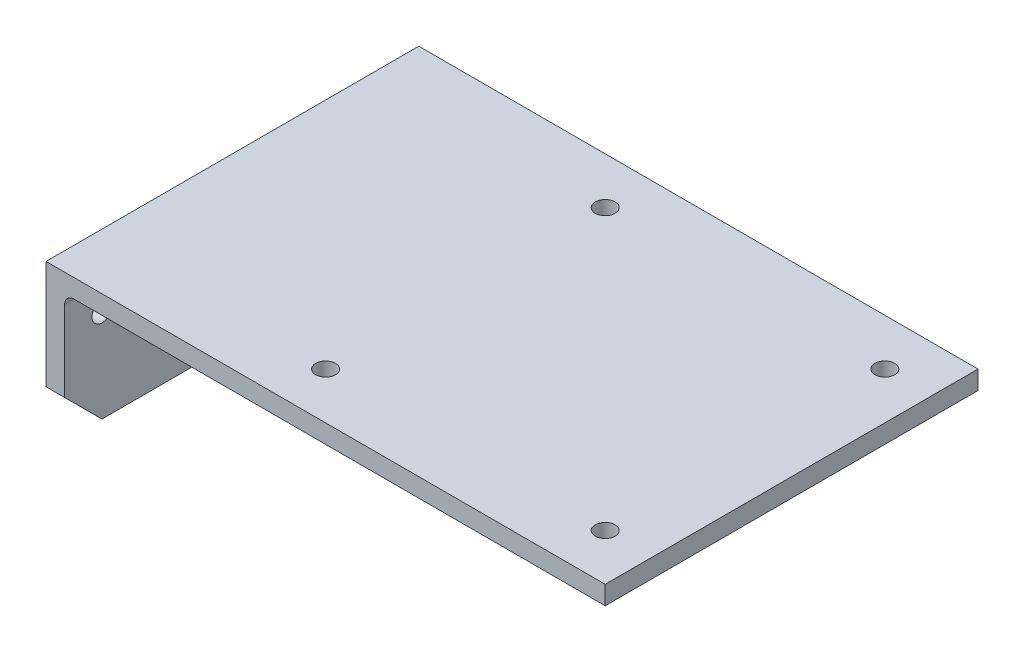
ISO-10303-21;
HEADER;
FILE_DESCRIPTION(('STEP AP214'),'2;1');
FILE_NAME('part.step','',(''),(''),'','','');
FILE_SCHEMA(('AUTOMOTIVE_DESIGN { 1 0 10303 214 1 1 1 1 }'));
ENDSEC;
DATA;
#1=APPLICATION_CONTEXT('core data for automotive mechanical design processes');
#2=APPLICATION_PROTOCOL_DEFINITION('international standard','automotive_design',2000,#1);
#3=PRODUCT_CONTEXT('',#1,'mechanical');
#4=PRODUCT('Part','Part','',(#3));
#5=PRODUCT_RELATED_PRODUCT_CATEGORY('part','',(#4));
#6=PRODUCT_DEFINITION_FORMATION('','',#4);
#7=PRODUCT_DEFINITION_CONTEXT('part definition',#1,'design');
#8=PRODUCT_DEFINITION('design','',#6,#7);
#9=PRODUCT_DEFINITION_SHAPE('','',#8);
#10=(LENGTH_UNIT() NAMED_UNIT(*) SI_UNIT(.MILLI.,.METRE.));
#11=(NAMED_UNIT(*) PLANE_ANGLE_UNIT() SI_UNIT($,.RADIAN.));
#12=(NAMED_UNIT(*) SI_UNIT($,.STERADIAN.) SOLID_ANGLE_UNIT());
#13=UNCERTAINTY_MEASURE_WITH_UNIT(LENGTH_MEASURE(1.E-05),#10,'distance_accuracy_value','');
#14=(GEOMETRIC_REPRESENTATION_CONTEXT(3) GLOBAL_UNCERTAINTY_ASSIGNED_CONTEXT((#13)) GLOBAL_UNIT_ASSIGNED_CONTEXT((#10,
#11,#12)) REPRESENTATION_CONTEXT('',''));
#15=CARTESIAN_POINT('',(0.,0.,0.));
#16=DIRECTION('',(0.,0.,1.));
#17=DIRECTION('',(1.,0.,0.));
#18=AXIS2_PLACEMENT_3D('',#15,#16,#17);
#19=CARTESIAN_POINT('',(-127.,0.,-323.871706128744));
#20=DIRECTION('',(-1.,0.,0.));
#21=DIRECTION('',(0.,0.,1.));
#22=AXIS2_PLACEMENT_3D('',#19,#20,#21);
#23=PLANE('',#22);
#24=CARTESIAN_POINT('',(-127.,-17.9311702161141,-114.3));
#25=DIRECTION('',(1.,0.,0.));
#26=DIRECTION('',(0.,-1.,0.));
#27=AXIS2_PLACEMENT_3D('',#24,#25,#26);
#28=CIRCLE('',#27,3.37819999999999);
#29=CARTESIAN_POINT('',(-127.,-21.3093702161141,-114.3));
#30=VERTEX_POINT('',#29);
#31=EDGE_CURVE('E209',#30,#30,#28,.T.);
#32=ORIENTED_EDGE('',*,*,#31,.T.);
#33=EDGE_LOOP('',(#32));
#34=FACE_BOUND('',#33,.T.);
#35=CARTESIAN_POINT('',(-127.,-36.9811702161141,-63.5));
#36=DIRECTION('',(1.,0.,0.));
#37=DIRECTION('',(0.,1.,0.));
#38=AXIS2_PLACEMENT_3D('',#35,#36,#37);
#39=CIRCLE('',#38,3.37819999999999);
#40=CARTESIAN_POINT('',(-127.,-33.6029702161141,-63.5));
#41=VERTEX_POINT('',#40);
#42=EDGE_CURVE('E203',#41,#41,#39,.T.);
#43=ORIENTED_EDGE('',*,*,#42,.T.);
#44=EDGE_LOOP('',(#43));
#45=FACE_BOUND('',#44,.T.);
#46=CARTESIAN_POINT('',(-127.,-17.9311702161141,-12.7));
#47=DIRECTION('',(1.,0.,0.));
#48=DIRECTION('',(0.,1.,0.));
#49=AXIS2_PLACEMENT_3D('',#46,#47,#48);
#50=CIRCLE('',#49,3.3782);
#51=CARTESIAN_POINT('',(-127.,-14.5529702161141,-12.7));
#52=VERTEX_POINT('',#51);
#53=EDGE_CURVE('E199',#52,#52,#50,.T.);
#54=ORIENTED_EDGE('',*,*,#53,.T.);
#55=EDGE_LOOP('',(#54));
#56=FACE_BOUND('',#55,.T.);
#57=DIRECTION('',(0.,1.,0.));
#58=VECTOR('',#57,1.);
#59=CARTESIAN_POINT('',(-127.,0.,-127.));
#60=LINE('',#59,#58);
#61=CARTESIAN_POINT('',(-127.,-36.9811702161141,-127.));
#62=VERTEX_POINT('',#61);
#63=CARTESIAN_POINT('',(-127.,0.,-127.));
#64=VERTEX_POINT('',#63);
#65=EDGE_CURVE('E138',#62,#64,#60,.T.);
#66=ORIENTED_EDGE('',*,*,#65,.F.);
#67=DIRECTION('',(0.,-0.707106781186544,0.707106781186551));
#68=VECTOR('',#67,1.);
#69=CARTESIAN_POINT('',(-127.,79.9452679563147,-243.92643817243));
#70=LINE('',#69,#68);
#71=CARTESIAN_POINT('',(-127.,-49.6811702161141,-114.3));
#72=VERTEX_POINT('',#71);
#73=EDGE_CURVE('E140',#62,#72,#70,.T.);
#74=ORIENTED_EDGE('',*,*,#73,.T.);
#75=DIRECTION('',(0.,0.,1.));
#76=VECTOR('',#75,1.);
#77=CARTESIAN_POINT('',(-127.,-49.6811702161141,-323.871706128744));
#78=LINE('',#77,#76);
#79=CARTESIAN_POINT('',(-127.,-49.6811702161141,-12.7000000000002));
#80=VERTEX_POINT('',#79);
#81=EDGE_CURVE('E122',#72,#80,#78,.T.);
#82=ORIENTED_EDGE('',*,*,#81,.T.);
#83=DIRECTION('',(0.,-0.707106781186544,-0.707106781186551));
#84=VECTOR('',#83,1.);
#85=CARTESIAN_POINT('',(-127.,-180.426438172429,-143.445267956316));
#86=LINE('',#85,#84);
#87=CARTESIAN_POINT('',(-127.,-36.981170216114,0.));
#88=VERTEX_POINT('',#87);
#89=EDGE_CURVE('E137',#80,#88,#86,.F.);
#90=ORIENTED_EDGE('',*,*,#89,.T.);
#91=DIRECTION('',(0.,-1.,0.));
#92=VECTOR('',#91,1.);
#93=CARTESIAN_POINT('',(-127.,0.,0.));
#94=LINE('',#93,#92);
#95=CARTESIAN_POINT('',(-127.,0.,0.));
#96=VERTEX_POINT('',#95);
#97=EDGE_CURVE('E165',#96,#88,#94,.T.);
#98=ORIENTED_EDGE('',*,*,#97,.F.);
#99=DIRECTION('',(0.,0.,1.));
#100=VECTOR('',#99,1.);
#101=CARTESIAN_POINT('',(-127.,0.,-323.871706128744));
#102=LINE('',#101,#100);
#103=EDGE_CURVE('E126',#64,#96,#102,.T.);
#104=ORIENTED_EDGE('',*,*,#103,.F.);
#105=EDGE_LOOP('',(#66,#74,#82,#90,#98,#104));
#106=FACE_BOUND('',#105,.T.);
#107=ADVANCED_FACE('F31',(#34,#45,#56,#106),#23,.T.);
#108=CARTESIAN_POINT('',(-127.,0.,-323.871706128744));
#109=DIRECTION('',(0.,1.,0.));
#110=DIRECTION('',(-1.,0.,0.));
#111=AXIS2_PLACEMENT_3D('',#108,#109,#110);
#112=PLANE('',#111);
#113=CARTESIAN_POINT('',(-47.625,0.,-15.875));
#114=DIRECTION('',(0.,1.,0.));
#115=DIRECTION('',(-1.,0.,0.));
#116=AXIS2_PLACEMENT_3D('',#113,#114,#115);
#117=CIRCLE('',#116,3.375);
#118=CARTESIAN_POINT('',(-51.,0.,-15.875));
#119=VERTEX_POINT('',#118);
#120=EDGE_CURVE('E193',#119,#119,#117,.T.);
#121=ORIENTED_EDGE('',*,*,#120,.F.);
#122=EDGE_LOOP('',(#121));
#123=FACE_BOUND('',#122,.T.);
#124=CARTESIAN_POINT('',(47.625,0.,-15.8750000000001));
#125=DIRECTION('',(0.,1.,0.));
#126=DIRECTION('',(-1.,0.,0.));
#127=AXIS2_PLACEMENT_3D('',#124,#125,#126);
#128=CIRCLE('',#127,3.375);
#129=CARTESIAN_POINT('',(44.25,0.,-15.8750000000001));
#130=VERTEX_POINT('',#129);
#131=EDGE_CURVE('E187',#130,#130,#128,.T.);
#132=ORIENTED_EDGE('',*,*,#131,.F.);
#133=EDGE_LOOP('',(#132));
#134=FACE_BOUND('',#133,.T.);
#135=CARTESIAN_POINT('',(47.625,0.,-111.125));
#136=DIRECTION('',(0.,1.,0.));
#137=DIRECTION('',(-1.,0.,0.));
#138=AXIS2_PLACEMENT_3D('',#135,#136,#137);
#139=CIRCLE('',#138,3.375);
#140=CARTESIAN_POINT('',(44.25,0.,-111.125));
#141=VERTEX_POINT('',#140);
#142=EDGE_CURVE('E181',#141,#141,#139,.T.);
#143=ORIENTED_EDGE('',*,*,#142,.F.);
#144=EDGE_LOOP('',(#143));
#145=FACE_BOUND('',#144,.T.);
#146=CARTESIAN_POINT('',(-47.625,0.,-111.125));
#147=DIRECTION('',(0.,1.,0.));
#148=DIRECTION('',(-1.,0.,0.));
#149=AXIS2_PLACEMENT_3D('',#146,#147,#148);
#150=CIRCLE('',#149,3.375);
#151=CARTESIAN_POINT('',(-51.,0.,-111.125));
#152=VERTEX_POINT('',#151);
#153=EDGE_CURVE('E166',#152,#152,#150,.T.);
#154=ORIENTED_EDGE('',*,*,#153,.F.);
#155=EDGE_LOOP('',(#154));
#156=FACE_BOUND('',#155,.T.);
#157=DIRECTION('',(1.,0.,0.));
#158=VECTOR('',#157,1.);
#159=CARTESIAN_POINT('',(-127.,0.,-127.));
#160=LINE('',#159,#158);
#161=CARTESIAN_POINT('',(63.5,0.,-127.));
#162=VERTEX_POINT('',#161);
#163=EDGE_CURVE('E170',#64,#162,#160,.T.);
#164=ORIENTED_EDGE('',*,*,#163,.F.);
#165=ORIENTED_EDGE('',*,*,#103,.T.);
#166=DIRECTION('',(-1.,0.,0.));
#167=VECTOR('',#166,1.);
#168=CARTESIAN_POINT('',(-127.,0.,0.));
#169=LINE('',#168,#167);
#170=CARTESIAN_POINT('',(63.5,0.,0.));
#171=VERTEX_POINT('',#170);
#172=EDGE_CURVE('E120',#171,#96,#169,.T.);
#173=ORIENTED_EDGE('',*,*,#172,.F.);
#174=DIRECTION('',(0.,0.,1.));
#175=VECTOR('',#174,1.);
#176=CARTESIAN_POINT('',(63.5,0.,-323.871706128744));
#177=LINE('',#176,#175);
#178=EDGE_CURVE('E115',#162,#171,#177,.T.);
#179=ORIENTED_EDGE('',*,*,#178,.F.);
#180=EDGE_LOOP('',(#164,#165,#173,#179));
#181=FACE_BOUND('',#180,.T.);
#182=ADVANCED_FACE('F252',(#123,#134,#145,#156,#181),#112,.T.);
#183=CARTESIAN_POINT('',(63.5,0.,-323.871706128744));
#184=DIRECTION('',(1.,0.,0.));
#185=DIRECTION('',(0.,1.,0.));
#186=AXIS2_PLACEMENT_3D('',#183,#184,#185);
#187=PLANE('',#186);
#188=DIRECTION('',(0.,-1.,0.));
#189=VECTOR('',#188,1.);
#190=CARTESIAN_POINT('',(63.5,0.,-127.));
#191=LINE('',#190,#189);
#192=CARTESIAN_POINT('',(63.5,-6.35,-127.));
#193=VERTEX_POINT('',#192);
#194=EDGE_CURVE('E172',#162,#193,#191,.T.);
#195=ORIENTED_EDGE('',*,*,#194,.F.);
#196=ORIENTED_EDGE('',*,*,#178,.T.);
#197=DIRECTION('',(0.,1.,0.));
#198=VECTOR('',#197,1.);
#199=CARTESIAN_POINT('',(63.5,0.,0.));
#200=LINE('',#199,#198);
#201=CARTESIAN_POINT('',(63.5,-6.35,0.));
#202=VERTEX_POINT('',#201);
#203=EDGE_CURVE('E105',#202,#171,#200,.T.);
#204=ORIENTED_EDGE('',*,*,#203,.F.);
#205=DIRECTION('',(0.,0.,1.));
#206=VECTOR('',#205,1.);
#207=CARTESIAN_POINT('',(63.5,-6.35,-323.871706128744));
#208=LINE('',#207,#206);
#209=EDGE_CURVE('E110',#193,#202,#208,.T.);
#210=ORIENTED_EDGE('',*,*,#209,.F.);
#211=EDGE_LOOP('',(#195,#196,#204,#210));
#212=FACE_BOUND('',#211,.T.);
#213=ADVANCED_FACE('F118',(#212),#187,.T.);
#214=CARTESIAN_POINT('',(-120.65,-6.35,-323.871706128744));
#215=DIRECTION('',(0.,-1.,0.));
#216=DIRECTION('',(0.,0.,-1.));
#217=AXIS2_PLACEMENT_3D('',#214,#215,#216);
#218=PLANE('',#217);
#219=CARTESIAN_POINT('',(-47.625,-6.35,-15.875));
#220=DIRECTION('',(0.,-1.,0.));
#221=DIRECTION('',(1.,0.,0.));
#222=AXIS2_PLACEMENT_3D('',#219,#220,#221);
#223=CIRCLE('',#222,3.375);
#224=CARTESIAN_POINT('',(-44.25,-6.35,-15.875));
#225=VERTEX_POINT('',#224);
#226=EDGE_CURVE('E196',#225,#225,#223,.T.);
#227=ORIENTED_EDGE('',*,*,#226,.F.);
#228=EDGE_LOOP('',(#227));
#229=FACE_BOUND('',#228,.T.);
#230=CARTESIAN_POINT('',(47.625,-6.35,-15.8750000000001));
#231=DIRECTION('',(0.,-1.,0.));
#232=DIRECTION('',(1.,0.,0.));
#233=AXIS2_PLACEMENT_3D('',#230,#231,#232);
#234=CIRCLE('',#233,3.375);
#235=CARTESIAN_POINT('',(51.,-6.35,-15.8750000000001));
#236=VERTEX_POINT('',#235);
#237=EDGE_CURVE('E190',#236,#236,#234,.T.);
#238=ORIENTED_EDGE('',*,*,#237,.F.);
#239=EDGE_LOOP('',(#238));
#240=FACE_BOUND('',#239,.T.);
#241=CARTESIAN_POINT('',(47.625,-6.35,-111.125));
#242=DIRECTION('',(0.,-1.,0.));
#243=DIRECTION('',(1.,0.,0.));
#244=AXIS2_PLACEMENT_3D('',#241,#242,#243);
#245=CIRCLE('',#244,3.375);
#246=CARTESIAN_POINT('',(51.,-6.35,-111.125));
#247=VERTEX_POINT('',#246);
#248=EDGE_CURVE('E184',#247,#247,#245,.T.);
#249=ORIENTED_EDGE('',*,*,#248,.F.);
#250=EDGE_LOOP('',(#249));
#251=FACE_BOUND('',#250,.T.);
#252=CARTESIAN_POINT('',(-47.625,-6.35,-111.125));
#253=DIRECTION('',(0.,-1.,0.));
#254=DIRECTION('',(1.,0.,0.));
#255=AXIS2_PLACEMENT_3D('',#252,#253,#254);
#256=CIRCLE('',#255,3.375);
#257=CARTESIAN_POINT('',(-44.25,-6.35,-111.125));
#258=VERTEX_POINT('',#257);
#259=EDGE_CURVE('E178',#258,#258,#256,.T.);
#260=ORIENTED_EDGE('',*,*,#259,.F.);
#261=EDGE_LOOP('',(#260));
#262=FACE_BOUND('',#261,.T.);
#263=DIRECTION('',(1.,0.,0.));
#264=VECTOR('',#263,1.);
#265=CARTESIAN_POINT('',(-120.65,-6.35,0.));
#266=LINE('',#265,#264);
#267=CARTESIAN_POINT('',(-117.475,-6.35,0.));
#268=VERTEX_POINT('',#267);
#269=EDGE_CURVE('E99',#268,#202,#266,.T.);
#270=ORIENTED_EDGE('',*,*,#269,.F.);
#271=DIRECTION('',(0.,0.,1.));
#272=VECTOR('',#271,1.);
#273=CARTESIAN_POINT('',(-117.475,-6.35,-127.));
#274=LINE('',#273,#272);
#275=CARTESIAN_POINT('',(-117.475,-6.35,-127.));
#276=VERTEX_POINT('',#275);
#277=EDGE_CURVE('E52',#268,#276,#274,.F.);
#278=ORIENTED_EDGE('',*,*,#277,.T.);
#279=DIRECTION('',(-1.,0.,0.));
#280=VECTOR('',#279,1.);
#281=CARTESIAN_POINT('',(-120.65,-6.35,-127.));
#282=LINE('',#281,#280);
#283=EDGE_CURVE('E112',#193,#276,#282,.T.);
#284=ORIENTED_EDGE('',*,*,#283,.F.);
#285=ORIENTED_EDGE('',*,*,#209,.T.);
#286=EDGE_LOOP('',(#270,#278,#284,#285));
#287=FACE_BOUND('',#286,.T.);
#288=ADVANCED_FACE('F111',(#229,#240,#251,#262,#287),#218,.T.);
#289=CARTESIAN_POINT('',(-120.65,-6.35,-323.871706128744));
#290=DIRECTION('',(1.,0.,0.));
#291=DIRECTION('',(0.,0.,-1.));
#292=AXIS2_PLACEMENT_3D('',#289,#290,#291);
#293=PLANE('',#292);
#294=CARTESIAN_POINT('',(-120.65,-17.9311702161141,-114.3));
#295=DIRECTION('',(1.,0.,0.));
#296=DIRECTION('',(0.,-1.,0.));
#297=AXIS2_PLACEMENT_3D('',#294,#295,#296);
#298=CIRCLE('',#297,3.37819999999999);
#299=CARTESIAN_POINT('',(-120.65,-21.3093702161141,-114.3));
#300=VERTEX_POINT('',#299);
#301=EDGE_CURVE('E212',#300,#300,#298,.T.);
#302=ORIENTED_EDGE('',*,*,#301,.F.);
#303=EDGE_LOOP('',(#302));
#304=FACE_BOUND('',#303,.T.);
#305=CARTESIAN_POINT('',(-120.65,-36.9811702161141,-63.5));
#306=DIRECTION('',(1.,0.,0.));
#307=DIRECTION('',(0.,1.,0.));
#308=AXIS2_PLACEMENT_3D('',#305,#306,#307);
#309=CIRCLE('',#308,3.37819999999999);
#310=CARTESIAN_POINT('',(-120.65,-33.6029702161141,-63.5));
#311=VERTEX_POINT('',#310);
#312=EDGE_CURVE('E206',#311,#311,#309,.T.);
#313=ORIENTED_EDGE('',*,*,#312,.F.);
#314=EDGE_LOOP('',(#313));
#315=FACE_BOUND('',#314,.T.);
#316=CARTESIAN_POINT('',(-120.65,-17.9311702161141,-12.7));
#317=DIRECTION('',(1.,0.,0.));
#318=DIRECTION('',(0.,1.,0.));
#319=AXIS2_PLACEMENT_3D('',#316,#317,#318);
#320=CIRCLE('',#319,3.3782);
#321=CARTESIAN_POINT('',(-120.65,-14.5529702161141,-12.7));
#322=VERTEX_POINT('',#321);
#323=EDGE_CURVE('E200',#322,#322,#320,.T.);
#324=ORIENTED_EDGE('',*,*,#323,.F.);
#325=EDGE_LOOP('',(#324));
#326=FACE_BOUND('',#325,.T.);
#327=DIRECTION('',(0.,-1.,0.));
#328=VECTOR('',#327,1.);
#329=CARTESIAN_POINT('',(-120.65,-6.35,-127.));
#330=LINE('',#329,#328);
#331=CARTESIAN_POINT('',(-120.65,-9.525,-127.));
#332=VERTEX_POINT('',#331);
#333=CARTESIAN_POINT('',(-120.65,-36.981170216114,-127.));
#334=VERTEX_POINT('',#333);
#335=EDGE_CURVE('E128',#332,#334,#330,.T.);
#336=ORIENTED_EDGE('',*,*,#335,.F.);
#337=DIRECTION('',(0.,0.,1.));
#338=VECTOR('',#337,1.);
#339=CARTESIAN_POINT('',(-120.65,-9.525,0.));
#340=LINE('',#339,#338);
#341=CARTESIAN_POINT('',(-120.65,-9.525,0.));
#342=VERTEX_POINT('',#341);
#343=EDGE_CURVE('E154',#332,#342,#340,.T.);
#344=ORIENTED_EDGE('',*,*,#343,.T.);
#345=DIRECTION('',(0.,1.,0.));
#346=VECTOR('',#345,1.);
#347=CARTESIAN_POINT('',(-120.65,-6.35,0.));
#348=LINE('',#347,#346);
#349=CARTESIAN_POINT('',(-120.65,-36.9811702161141,0.));
#350=VERTEX_POINT('',#349);
#351=EDGE_CURVE('E107',#350,#342,#348,.T.);
#352=ORIENTED_EDGE('',*,*,#351,.F.);
#353=DIRECTION('',(0.,0.707106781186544,0.707106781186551));
#354=VECTOR('',#353,1.);
#355=CARTESIAN_POINT('',(-120.65,-183.601438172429,-146.620267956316));
#356=LINE('',#355,#354);
#357=CARTESIAN_POINT('',(-120.65,-49.6811702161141,-12.7000000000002));
#358=VERTEX_POINT('',#357);
#359=EDGE_CURVE('E146',#350,#358,#356,.F.);
#360=ORIENTED_EDGE('',*,*,#359,.T.);
#361=DIRECTION('',(0.,0.,1.));
#362=VECTOR('',#361,1.);
#363=CARTESIAN_POINT('',(-120.65,-49.6811702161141,-323.871706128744));
#364=LINE('',#363,#362);
#365=CARTESIAN_POINT('',(-120.65,-49.6811702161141,-114.3));
#366=VERTEX_POINT('',#365);
#367=EDGE_CURVE('E116',#366,#358,#364,.T.);
#368=ORIENTED_EDGE('',*,*,#367,.F.);
#369=DIRECTION('',(0.,0.707106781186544,-0.707106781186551));
#370=VECTOR('',#369,1.);
#371=CARTESIAN_POINT('',(-120.65,76.7702679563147,-240.75143817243));
#372=LINE('',#371,#370);
#373=EDGE_CURVE('E148',#366,#334,#372,.T.);
#374=ORIENTED_EDGE('',*,*,#373,.T.);
#375=EDGE_LOOP('',(#336,#344,#352,#360,#368,#374));
#376=FACE_BOUND('',#375,.T.);
#377=ADVANCED_FACE('F161',(#304,#315,#326,#376),#293,.T.);
#378=CARTESIAN_POINT('',(-127.,-49.6811702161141,-323.871706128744));
#379=DIRECTION('',(0.,-1.,0.));
#380=DIRECTION('',(0.,0.,-1.));
#381=AXIS2_PLACEMENT_3D('',#378,#379,#380);
#382=PLANE('',#381);
#383=ORIENTED_EDGE('',*,*,#81,.F.);
#384=DIRECTION('',(1.,0.,0.));
#385=VECTOR('',#384,1.);
#386=CARTESIAN_POINT('',(-120.65,-49.6811702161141,-114.3));
#387=LINE('',#386,#385);
#388=EDGE_CURVE('E144',#72,#366,#387,.T.);
#389=ORIENTED_EDGE('',*,*,#388,.T.);
#390=ORIENTED_EDGE('',*,*,#367,.T.);
#391=DIRECTION('',(-1.,0.,0.));
#392=VECTOR('',#391,1.);
#393=CARTESIAN_POINT('',(-127.,-49.6811702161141,-12.7000000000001));
#394=LINE('',#393,#392);
#395=EDGE_CURVE('E142',#358,#80,#394,.T.);
#396=ORIENTED_EDGE('',*,*,#395,.T.);
#397=EDGE_LOOP('',(#383,#389,#390,#396));
#398=FACE_BOUND('',#397,.T.);
#399=ADVANCED_FACE('F230',(#398),#382,.T.);
#400=CARTESIAN_POINT('',(-127.,-49.6811702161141,0.));
#401=DIRECTION('',(0.,0.,1.));
#402=DIRECTION('',(1.,0.,0.));
#403=AXIS2_PLACEMENT_3D('',#400,#401,#402);
#404=PLANE('',#403);
#405=ORIENTED_EDGE('',*,*,#97,.T.);
#406=DIRECTION('',(1.,0.,0.));
#407=VECTOR('',#406,1.);
#408=CARTESIAN_POINT('',(-127.,-36.9811702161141,0.));
#409=LINE('',#408,#407);
#410=EDGE_CURVE('E151',#88,#350,#409,.T.);
#411=ORIENTED_EDGE('',*,*,#410,.T.);
#412=ORIENTED_EDGE('',*,*,#351,.T.);
#413=CARTESIAN_POINT('',(-117.475,-9.525,0.));
#414=DIRECTION('',(0.,0.,1.));
#415=DIRECTION('',(1.,0.,0.));
#416=AXIS2_PLACEMENT_3D('',#413,#414,#415);
#417=CIRCLE('',#416,3.175);
#418=EDGE_CURVE('E39',#342,#268,#417,.F.);
#419=ORIENTED_EDGE('',*,*,#418,.T.);
#420=ORIENTED_EDGE('',*,*,#269,.T.);
#421=ORIENTED_EDGE('',*,*,#203,.T.);
#422=ORIENTED_EDGE('',*,*,#172,.T.);
#423=EDGE_LOOP('',(#405,#411,#412,#419,#420,#421,#422));
#424=FACE_BOUND('',#423,.T.);
#425=ADVANCED_FACE('F102',(#424),#404,.T.);
#426=CARTESIAN_POINT('',(63.5,50.8,-127.));
#427=DIRECTION('',(0.,0.,1.));
#428=DIRECTION('',(0.,1.,0.));
#429=AXIS2_PLACEMENT_3D('',#426,#427,#428);
#430=PLANE('',#429);
#431=ORIENTED_EDGE('',*,*,#283,.T.);
#432=CARTESIAN_POINT('',(-117.475,-9.525,-127.));
#433=DIRECTION('',(0.,0.,1.));
#434=DIRECTION('',(1.,0.,0.));
#435=AXIS2_PLACEMENT_3D('',#432,#433,#434);
#436=CIRCLE('',#435,3.175);
#437=EDGE_CURVE('E11',#276,#332,#436,.T.);
#438=ORIENTED_EDGE('',*,*,#437,.T.);
#439=ORIENTED_EDGE('',*,*,#335,.T.);
#440=DIRECTION('',(-1.,0.,0.));
#441=VECTOR('',#440,1.);
#442=CARTESIAN_POINT('',(-127.,-36.9811702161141,-127.));
#443=LINE('',#442,#441);
#444=EDGE_CURVE('E134',#334,#62,#443,.T.);
#445=ORIENTED_EDGE('',*,*,#444,.T.);
#446=ORIENTED_EDGE('',*,*,#65,.T.);
#447=ORIENTED_EDGE('',*,*,#163,.T.);
#448=ORIENTED_EDGE('',*,*,#194,.T.);
#449=EDGE_LOOP('',(#431,#438,#439,#445,#446,#447,#448));
#450=FACE_BOUND('',#449,.T.);
#451=ADVANCED_FACE('F279',(#450),#430,.F.);
#452=CARTESIAN_POINT('',(-47.625,3.65,-111.125));
#453=DIRECTION('',(0.,-1.,0.));
#454=DIRECTION('',(1.,0.,0.));
#455=AXIS2_PLACEMENT_3D('',#452,#453,#454);
#456=CYLINDRICAL_SURFACE('',#455,3.375);
#457=ORIENTED_EDGE('',*,*,#153,.T.);
#458=EDGE_LOOP('',(#457));
#459=FACE_BOUND('',#458,.T.);
#460=ORIENTED_EDGE('',*,*,#259,.T.);
#461=EDGE_LOOP('',(#460));
#462=FACE_BOUND('',#461,.T.);
#463=ADVANCED_FACE('F293',(#459,#462),#456,.F.);
#464=CARTESIAN_POINT('',(47.625,3.65,-111.125));
#465=DIRECTION('',(0.,-1.,0.));
#466=DIRECTION('',(1.,0.,0.));
#467=AXIS2_PLACEMENT_3D('',#464,#465,#466);
#468=CYLINDRICAL_SURFACE('',#467,3.375);
#469=ORIENTED_EDGE('',*,*,#142,.T.);
#470=EDGE_LOOP('',(#469));
#471=FACE_BOUND('',#470,.T.);
#472=ORIENTED_EDGE('',*,*,#248,.T.);
#473=EDGE_LOOP('',(#472));
#474=FACE_BOUND('',#473,.T.);
#475=ADVANCED_FACE('F312',(#471,#474),#468,.F.);
#476=CARTESIAN_POINT('',(47.625,3.65,-15.8750000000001));
#477=DIRECTION('',(0.,-1.,0.));
#478=DIRECTION('',(1.,0.,0.));
#479=AXIS2_PLACEMENT_3D('',#476,#477,#478);
#480=CYLINDRICAL_SURFACE('',#479,3.375);
#481=ORIENTED_EDGE('',*,*,#131,.T.);
#482=EDGE_LOOP('',(#481));
#483=FACE_BOUND('',#482,.T.);
#484=ORIENTED_EDGE('',*,*,#237,.T.);
#485=EDGE_LOOP('',(#484));
#486=FACE_BOUND('',#485,.T.);
#487=ADVANCED_FACE('F247',(#483,#486),#480,.F.);
#488=CARTESIAN_POINT('',(-47.625,3.65,-15.875));
#489=DIRECTION('',(0.,-1.,0.));
#490=DIRECTION('',(1.,0.,0.));
#491=AXIS2_PLACEMENT_3D('',#488,#489,#490);
#492=CYLINDRICAL_SURFACE('',#491,3.375);
#493=ORIENTED_EDGE('',*,*,#120,.T.);
#494=EDGE_LOOP('',(#493));
#495=FACE_BOUND('',#494,.T.);
#496=ORIENTED_EDGE('',*,*,#226,.T.);
#497=EDGE_LOOP('',(#496));
#498=FACE_BOUND('',#497,.T.);
#499=ADVANCED_FACE('F238',(#495,#498),#492,.F.);
#500=CARTESIAN_POINT('',(-127.,-17.9311702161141,-12.7));
#501=DIRECTION('',(1.,0.,0.));
#502=DIRECTION('',(0.,1.,0.));
#503=AXIS2_PLACEMENT_3D('',#500,#501,#502);
#504=CYLINDRICAL_SURFACE('',#503,3.3782);
#505=ORIENTED_EDGE('',*,*,#53,.F.);
#506=EDGE_LOOP('',(#505));
#507=FACE_BOUND('',#506,.T.);
#508=ORIENTED_EDGE('',*,*,#323,.T.);
#509=EDGE_LOOP('',(#508));
#510=FACE_BOUND('',#509,.T.);
#511=ADVANCED_FACE('F236',(#507,#510),#504,.F.);
#512=CARTESIAN_POINT('',(-127.,-36.9811702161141,-63.5));
#513=DIRECTION('',(1.,0.,0.));
#514=DIRECTION('',(0.,1.,0.));
#515=AXIS2_PLACEMENT_3D('',#512,#513,#514);
#516=CYLINDRICAL_SURFACE('',#515,3.37819999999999);
#517=ORIENTED_EDGE('',*,*,#42,.F.);
#518=EDGE_LOOP('',(#517));
#519=FACE_BOUND('',#518,.T.);
#520=ORIENTED_EDGE('',*,*,#312,.T.);
#521=EDGE_LOOP('',(#520));
#522=FACE_BOUND('',#521,.T.);
#523=ADVANCED_FACE('F224',(#519,#522),#516,.F.);
#524=CARTESIAN_POINT('',(-127.,-17.9311702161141,-114.3));
#525=DIRECTION('',(1.,0.,0.));
#526=DIRECTION('',(0.,1.,0.));
#527=AXIS2_PLACEMENT_3D('',#524,#525,#526);
#528=CYLINDRICAL_SURFACE('',#527,3.37819999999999);
#529=ORIENTED_EDGE('',*,*,#31,.F.);
#530=EDGE_LOOP('',(#529));
#531=FACE_BOUND('',#530,.T.);
#532=ORIENTED_EDGE('',*,*,#301,.T.);
#533=EDGE_LOOP('',(#532));
#534=FACE_BOUND('',#533,.T.);
#535=ADVANCED_FACE('F220',(#531,#534),#528,.F.);
#536=CARTESIAN_POINT('',(63.5,-36.9811702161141,-127.));
#537=DIRECTION('',(0.,-0.707106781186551,-0.707106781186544));
#538=DIRECTION('',(0.,0.707106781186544,-0.707106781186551));
#539=AXIS2_PLACEMENT_3D('',#536,#537,#538);
#540=PLANE('',#539);
#541=ORIENTED_EDGE('',*,*,#373,.F.);
#542=ORIENTED_EDGE('',*,*,#388,.F.);
#543=ORIENTED_EDGE('',*,*,#73,.F.);
#544=ORIENTED_EDGE('',*,*,#444,.F.);
#545=EDGE_LOOP('',(#541,#542,#543,#544));
#546=FACE_BOUND('',#545,.T.);
#547=ADVANCED_FACE('F223',(#546),#540,.T.);
#548=CARTESIAN_POINT('',(-127.,-36.9811702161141,0.));
#549=DIRECTION('',(0.,0.707106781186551,-0.707106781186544));
#550=DIRECTION('',(0.,0.707106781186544,0.707106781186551));
#551=AXIS2_PLACEMENT_3D('',#548,#549,#550);
#552=PLANE('',#551);
#553=ORIENTED_EDGE('',*,*,#89,.F.);
#554=ORIENTED_EDGE('',*,*,#395,.F.);
#555=ORIENTED_EDGE('',*,*,#359,.F.);
#556=ORIENTED_EDGE('',*,*,#410,.F.);
#557=EDGE_LOOP('',(#553,#554,#555,#556));
#558=FACE_BOUND('',#557,.T.);
#559=ADVANCED_FACE('F262',(#558),#552,.F.);
#560=CARTESIAN_POINT('',(-117.475,-9.525,-323.871706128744));
#561=DIRECTION('',(0.,0.,-1.));
#562=DIRECTION('',(-1.,0.,0.));
#563=AXIS2_PLACEMENT_3D('',#560,#561,#562);
#564=CYLINDRICAL_SURFACE('',#563,3.175);
#565=ORIENTED_EDGE('',*,*,#437,.F.);
#566=ORIENTED_EDGE('',*,*,#277,.F.);
#567=ORIENTED_EDGE('',*,*,#418,.F.);
#568=ORIENTED_EDGE('',*,*,#343,.F.);
#569=EDGE_LOOP('',(#565,#566,#567,#568));
#570=FACE_BOUND('',#569,.T.);
#571=ADVANCED_FACE('F33',(#570),#564,.F.);
#572=CLOSED_SHELL('',(#107,#182,#213,#288,#377,#399,#425,#451,#463,#475,#487,#499,#511,#523,
#535,#547,#559,#571));
#573=MANIFOLD_SOLID_BREP('B2',#572);
#574=ADVANCED_BREP_SHAPE_REPRESENTATION('',(#18,#573),#14);
#575=SHAPE_DEFINITION_REPRESENTATION(#9,#574);
ENDSEC;
END-ISO-10303-21;
